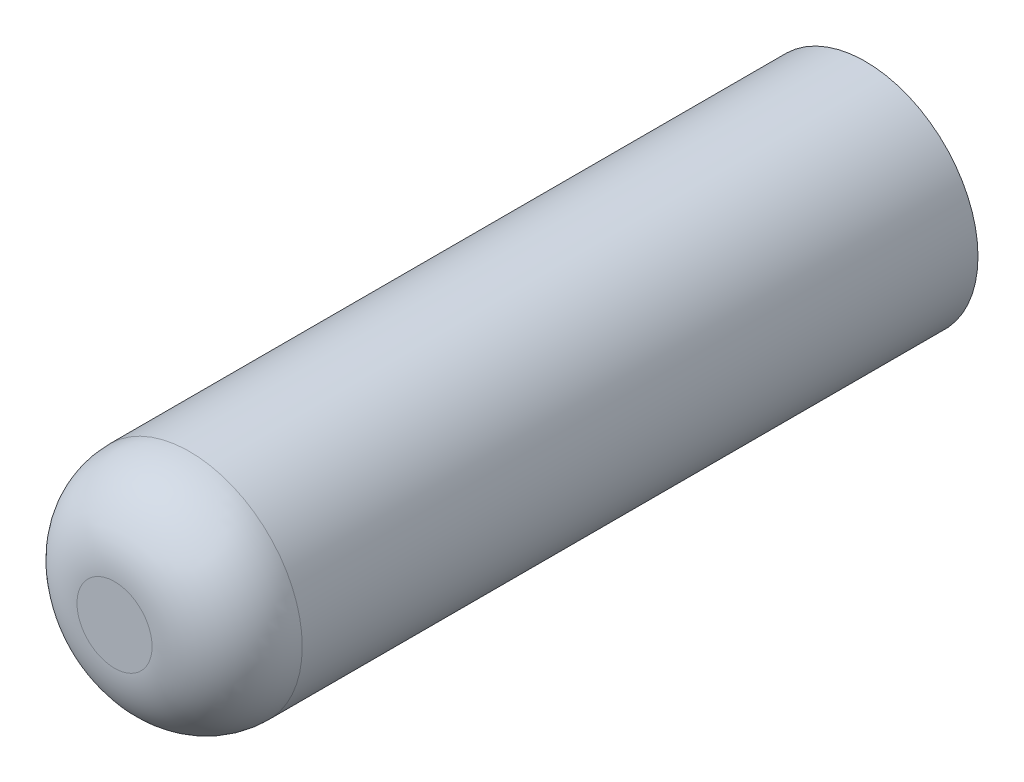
from build123d import *

# Parameters (mm, degrees)
SKETCH1_R      = 3
EXTRUDE1_DEPTH = 20
SKETCH2_R      = 1.5
EXTRUDE2_DEPTH = 8.5
FILLET1_R      = 2


with BuildPart() as part:
    # Sketch1 → Extrude1 (new body)
    with BuildSketch(Plane.XY):
        Circle(SKETCH1_R)
    extrude(amount=EXTRUDE1_DEPTH)

    # Sketch2 → Extrude2 (cut)
    with BuildSketch(Plane(origin=(0, 0, 0), x_dir=(-1, 0, 0), z_dir=(0, 0, -1))):
        Circle(SKETCH2_R)
    extrude(amount=-EXTRUDE2_DEPTH, mode=Mode.SUBTRACT)

    # Fillet1
    fillet1_edges = [part.edges().sort_by_distance(p)[0] for p in [
        (-3, 0, 20),
    ]]
    fillet(fillet1_edges, radius=FILLET1_R)


solid = part.part
